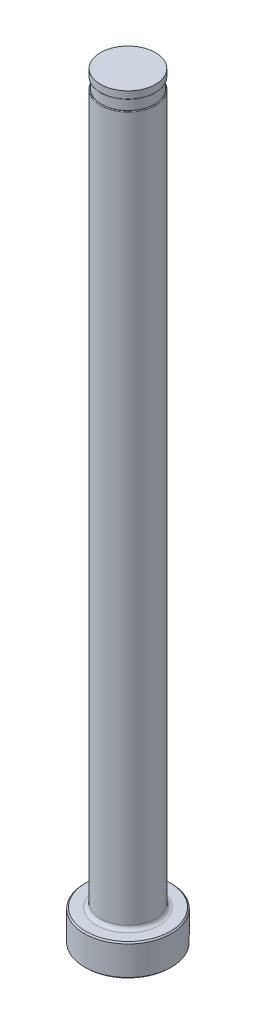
ISO-10303-21;
HEADER;
FILE_DESCRIPTION(('STEP AP214'),'2;1');
FILE_NAME('part.step','',(''),(''),'','','');
FILE_SCHEMA(('AUTOMOTIVE_DESIGN { 1 0 10303 214 1 1 1 1 }'));
ENDSEC;
DATA;
#1=APPLICATION_CONTEXT('core data for automotive mechanical design processes');
#2=APPLICATION_PROTOCOL_DEFINITION('international standard','automotive_design',2000,#1);
#3=PRODUCT_CONTEXT('',#1,'mechanical');
#4=PRODUCT('Part','Part','',(#3));
#5=PRODUCT_RELATED_PRODUCT_CATEGORY('part','',(#4));
#6=PRODUCT_DEFINITION_FORMATION('','',#4);
#7=PRODUCT_DEFINITION_CONTEXT('part definition',#1,'design');
#8=PRODUCT_DEFINITION('design','',#6,#7);
#9=PRODUCT_DEFINITION_SHAPE('','',#8);
#10=(LENGTH_UNIT() NAMED_UNIT(*) SI_UNIT(.MILLI.,.METRE.));
#11=(NAMED_UNIT(*) PLANE_ANGLE_UNIT() SI_UNIT($,.RADIAN.));
#12=(NAMED_UNIT(*) SI_UNIT($,.STERADIAN.) SOLID_ANGLE_UNIT());
#13=UNCERTAINTY_MEASURE_WITH_UNIT(LENGTH_MEASURE(1.E-05),#10,'distance_accuracy_value','');
#14=(GEOMETRIC_REPRESENTATION_CONTEXT(3) GLOBAL_UNCERTAINTY_ASSIGNED_CONTEXT((#13)) GLOBAL_UNIT_ASSIGNED_CONTEXT((#10,
#11,#12)) REPRESENTATION_CONTEXT('',''));
#15=CARTESIAN_POINT('',(0.,0.,0.));
#16=DIRECTION('',(0.,0.,1.));
#17=DIRECTION('',(1.,0.,0.));
#18=AXIS2_PLACEMENT_3D('',#15,#16,#17);
#19=CARTESIAN_POINT('',(-5.55624999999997,150.876,0.));
#20=DIRECTION('',(0.,1.,0.));
#21=DIRECTION('',(0.,0.,1.));
#22=AXIS2_PLACEMENT_3D('',#19,#20,#21);
#23=PLANE('',#22);
#24=CARTESIAN_POINT('',(0.,150.876,0.));
#25=DIRECTION('',(0.,1.,0.));
#26=DIRECTION('',(0.,0.,1.));
#27=AXIS2_PLACEMENT_3D('',#24,#25,#26);
#28=CIRCLE('',#27,5.40384999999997);
#29=CARTESIAN_POINT('',(0.,150.876,5.40384999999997));
#30=VERTEX_POINT('',#29);
#31=EDGE_CURVE('E11',#30,#30,#28,.F.);
#32=ORIENTED_EDGE('',*,*,#31,.T.);
#33=EDGE_LOOP('',(#32));
#34=FACE_BOUND('',#33,.T.);
#35=CARTESIAN_POINT('',(0.,150.876,0.));
#36=DIRECTION('',(0.,1.,0.));
#37=DIRECTION('',(0.,0.,1.));
#38=AXIS2_PLACEMENT_3D('',#35,#36,#37);
#39=CIRCLE('',#38,5.35304999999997);
#40=CARTESIAN_POINT('',(0.,150.876,5.35304999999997));
#41=VERTEX_POINT('',#40);
#42=EDGE_CURVE('E78',#41,#41,#39,.T.);
#43=ORIENTED_EDGE('',*,*,#42,.T.);
#44=EDGE_LOOP('',(#43));
#45=FACE_BOUND('',#44,.T.);
#46=ADVANCED_FACE('F36',(#34,#45),#23,.F.);
#47=CARTESIAN_POINT('',(0.,259.958771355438,0.));
#48=DIRECTION('',(0.,1.,0.));
#49=DIRECTION('',(0.,0.,1.));
#50=AXIS2_PLACEMENT_3D('',#47,#48,#49);
#51=CYLINDRICAL_SURFACE('',#50,5.55624999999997);
#52=DIRECTION('',(0.,1.,0.));
#53=VECTOR('',#52,1.);
#54=CARTESIAN_POINT('',(-5.35304999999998,259.958771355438,-1.48888205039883));
#55=LINE('',#54,#53);
#56=CARTESIAN_POINT('',(-5.35304999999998,148.717,-1.48888205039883));
#57=VERTEX_POINT('',#56);
#58=CARTESIAN_POINT('',(-5.35304999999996,86.36,-1.48888205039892));
#59=VERTEX_POINT('',#58);
#60=EDGE_CURVE('E73',#57,#59,#55,.F.);
#61=ORIENTED_EDGE('',*,*,#60,.F.);
#62=CARTESIAN_POINT('',(0.,148.717,0.));
#63=DIRECTION('',(0.,-1.,0.));
#64=DIRECTION('',(0.,0.,-1.));
#65=AXIS2_PLACEMENT_3D('',#62,#63,#64);
#66=CIRCLE('',#65,5.55624999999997);
#67=CARTESIAN_POINT('',(-5.35304999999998,148.717,1.48888205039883));
#68=VERTEX_POINT('',#67);
#69=EDGE_CURVE('E51',#57,#68,#66,.T.);
#70=ORIENTED_EDGE('',*,*,#69,.T.);
#71=DIRECTION('',(0.,1.,0.));
#72=VECTOR('',#71,1.);
#73=CARTESIAN_POINT('',(-5.35304999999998,259.958771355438,1.48888205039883));
#74=LINE('',#73,#72);
#75=CARTESIAN_POINT('',(-5.35304999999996,86.36,1.48888205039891));
#76=VERTEX_POINT('',#75);
#77=EDGE_CURVE('E84',#76,#68,#74,.T.);
#78=ORIENTED_EDGE('',*,*,#77,.F.);
#79=CARTESIAN_POINT('',(-5.35304999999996,86.36,-1.48888205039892));
#80=CARTESIAN_POINT('',(-5.35304712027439,86.3319400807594,-1.48888592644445));
#81=CARTESIAN_POINT('',(-5.35342246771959,86.303898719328,-1.48754344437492));
#82=CARTESIAN_POINT('',(-5.35490012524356,86.2481072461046,-1.48221807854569));
#83=CARTESIAN_POINT('',(-5.3560019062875,86.2203569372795,-1.47823711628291));
#84=CARTESIAN_POINT('',(-5.36032637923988,86.1383774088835,-1.46251079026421));
#85=CARTESIAN_POINT('',(-5.36456936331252,86.0848852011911,-1.44697968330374));
#86=CARTESIAN_POINT('',(-5.37522073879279,85.9818696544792,-1.40688871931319));
#87=CARTESIAN_POINT('',(-5.38162399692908,85.9323372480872,-1.38235025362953));
#88=CARTESIAN_POINT('',(-5.39588416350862,85.8380393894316,-1.3255962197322));
#89=CARTESIAN_POINT('',(-5.40374399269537,85.7932838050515,-1.29336518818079));
#90=CARTESIAN_POINT('',(-5.42234104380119,85.6980810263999,-1.21335067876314));
#91=CARTESIAN_POINT('',(-5.43329059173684,85.6492435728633,-1.16370716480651));
#92=CARTESIAN_POINT('',(-5.45504519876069,85.5603973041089,-1.05705847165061));
#93=CARTESIAN_POINT('',(-5.46585002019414,85.5204016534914,-1.0000425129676));
#94=CARTESIAN_POINT('',(-5.48941062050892,85.4382379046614,-0.862814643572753));
#95=CARTESIAN_POINT('',(-5.50177933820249,85.3990172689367,-0.780775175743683));
#96=CARTESIAN_POINT('',(-5.52319531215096,85.3340184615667,-0.61119833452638));
#97=CARTESIAN_POINT('',(-5.53224012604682,85.3082501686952,-0.523656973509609));
#98=CARTESIAN_POINT('',(-5.54633656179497,85.2689210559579,-0.343981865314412));
#99=CARTESIAN_POINT('',(-5.551315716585,85.2555811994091,-0.251794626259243));
#100=CARTESIAN_POINT('',(-5.55663041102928,85.2413656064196,-0.0663077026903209));
#101=CARTESIAN_POINT('',(-5.5569631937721,85.2404972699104,0.0269926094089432));
#102=CARTESIAN_POINT('',(-5.55261816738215,85.2520778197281,0.228128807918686));
#103=CARTESIAN_POINT('',(-5.5471061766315,85.2667433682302,0.335828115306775));
#104=CARTESIAN_POINT('',(-5.53028051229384,85.3137503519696,0.546872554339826));
#105=CARTESIAN_POINT('',(-5.51897217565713,85.34607552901,0.650221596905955));
#106=CARTESIAN_POINT('',(-5.49592210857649,85.4177771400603,0.81966257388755));
#107=CARTESIAN_POINT('',(-5.48524552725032,85.452432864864,0.88790475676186));
#108=CARTESIAN_POINT('',(-5.46261932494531,85.5320662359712,1.01785270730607));
#109=CARTESIAN_POINT('',(-5.45067176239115,85.5770273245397,1.07956873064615));
#110=CARTESIAN_POINT('',(-5.42934912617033,85.6669408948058,1.18161350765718));
#111=CARTESIAN_POINT('',(-5.41996423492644,85.7098853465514,1.22370530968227));
#112=CARTESIAN_POINT('',(-5.40207756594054,85.8022163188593,1.30039205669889));
#113=CARTESIAN_POINT('',(-5.3935749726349,85.8515967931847,1.33499395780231));
#114=CARTESIAN_POINT('',(-5.37957377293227,85.9480291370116,1.39024779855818));
#115=CARTESIAN_POINT('',(-5.37381465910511,85.9942834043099,1.4122235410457));
#116=CARTESIAN_POINT('',(-5.36419527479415,86.0899194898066,1.44833565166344));
#117=CARTESIAN_POINT('',(-5.36033174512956,86.1392957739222,1.46248548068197));
#118=CARTESIAN_POINT('',(-5.3561211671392,86.217574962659,1.47780624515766));
#119=CARTESIAN_POINT('',(-5.35497463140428,86.24588137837,1.48194947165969));
#120=CARTESIAN_POINT('',(-5.35343719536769,86.3027860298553,1.48749027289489));
#121=CARTESIAN_POINT('',(-5.35304641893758,86.3313843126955,1.4888873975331));
#122=CARTESIAN_POINT('',(-5.35304999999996,86.36,1.48888205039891));
#123=B_SPLINE_CURVE_WITH_KNOTS('',3,(#79,#80,#81,#82,#83,#84,#85,#86,#87,#88,#89,#90,#91,#92,
#93,#94,#95,#96,#97,#98,#99,#100,#101,#102,#103,#104,#105,#106,#107,#108,#109,#110,#111,#112,
#113,#114,#115,#116,#117,#118,#119,#120,#121,#122),.UNSPECIFIED.,.F.,.F.,(4,2,2,2,2,2,2,2,2,2,2,
2,2,2,2,2,2,2,2,2,2,4),(0.,0.0841097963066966,0.168158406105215,0.334679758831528,
0.50080817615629,0.667273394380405,0.87762078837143,1.0882792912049,1.36213137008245,
1.63618427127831,1.91502141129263,2.19402399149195,2.51897339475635,2.84362413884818,
3.07466463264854,3.30533648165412,3.48723774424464,3.66896933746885,3.82292542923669,
3.97661588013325,4.06237930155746,4.14815677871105),.UNSPECIFIED.);
#124=EDGE_CURVE('E81',#59,#76,#123,.T.);
#125=ORIENTED_EDGE('',*,*,#124,.F.);
#126=EDGE_LOOP('',(#61,#70,#78,#125));
#127=FACE_BOUND('',#126,.T.);
#128=CARTESIAN_POINT('',(0.,7.11200000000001,0.));
#129=DIRECTION('',(0.,1.,0.));
#130=DIRECTION('',(0.,0.,1.));
#131=AXIS2_PLACEMENT_3D('',#128,#129,#130);
#132=CIRCLE('',#131,5.55624999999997);
#133=CARTESIAN_POINT('',(0.,7.11200000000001,5.55624999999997));
#134=VERTEX_POINT('',#133);
#135=EDGE_CURVE('E116',#134,#134,#132,.T.);
#136=ORIENTED_EDGE('',*,*,#135,.T.);
#137=EDGE_LOOP('',(#136));
#138=FACE_BOUND('',#137,.T.);
#139=ADVANCED_FACE('F82',(#127,#138),#51,.T.);
#140=CARTESIAN_POINT('',(0.,0.,0.));
#141=DIRECTION('',(0.,-1.,0.));
#142=DIRECTION('',(0.,0.,-1.));
#143=AXIS2_PLACEMENT_3D('',#140,#141,#142);
#144=PLANE('',#143);
#145=CARTESIAN_POINT('',(0.,0.,0.));
#146=DIRECTION('',(0.,-1.,0.));
#147=DIRECTION('',(0.,0.,-1.));
#148=AXIS2_PLACEMENT_3D('',#145,#146,#147);
#149=CIRCLE('',#148,8.47089999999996);
#150=CARTESIAN_POINT('',(0.,0.,-8.47089999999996));
#151=VERTEX_POINT('',#150);
#152=EDGE_CURVE('E113',#151,#151,#149,.T.);
#153=ORIENTED_EDGE('',*,*,#152,.T.);
#154=EDGE_LOOP('',(#153));
#155=FACE_BOUND('',#154,.T.);
#156=ADVANCED_FACE('F192',(#155),#144,.T.);
#157=CARTESIAN_POINT('',(0.,259.958771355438,0.));
#158=DIRECTION('',(0.,1.,0.));
#159=DIRECTION('',(0.,0.,1.));
#160=AXIS2_PLACEMENT_3D('',#157,#158,#159);
#161=CYLINDRICAL_SURFACE('',#160,8.72489999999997);
#162=CARTESIAN_POINT('',(0.,6.09600000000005,0.));
#163=DIRECTION('',(0.,1.,0.));
#164=DIRECTION('',(0.,0.,1.));
#165=AXIS2_PLACEMENT_3D('',#162,#163,#164);
#166=CIRCLE('',#165,8.72489999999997);
#167=CARTESIAN_POINT('',(0.,6.09600000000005,8.72489999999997));
#168=VERTEX_POINT('',#167);
#169=EDGE_CURVE('E110',#168,#168,#166,.F.);
#170=ORIENTED_EDGE('',*,*,#169,.T.);
#171=EDGE_LOOP('',(#170));
#172=FACE_BOUND('',#171,.T.);
#173=CARTESIAN_POINT('',(0.,0.254000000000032,0.));
#174=DIRECTION('',(0.,-1.,0.));
#175=DIRECTION('',(0.,0.,-1.));
#176=AXIS2_PLACEMENT_3D('',#173,#174,#175);
#177=CIRCLE('',#176,8.72489999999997);
#178=CARTESIAN_POINT('',(0.,0.254000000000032,-8.72489999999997));
#179=VERTEX_POINT('',#178);
#180=EDGE_CURVE('E107',#179,#179,#177,.F.);
#181=ORIENTED_EDGE('',*,*,#180,.T.);
#182=EDGE_LOOP('',(#181));
#183=FACE_BOUND('',#182,.T.);
#184=ADVANCED_FACE('F195',(#172,#183),#161,.T.);
#185=CARTESIAN_POINT('',(-8.72489999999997,6.35,0.));
#186=DIRECTION('',(0.,1.,0.));
#187=DIRECTION('',(0.,0.,1.));
#188=AXIS2_PLACEMENT_3D('',#185,#186,#187);
#189=PLANE('',#188);
#190=CARTESIAN_POINT('',(0.,6.35,0.));
#191=DIRECTION('',(0.,1.,0.));
#192=DIRECTION('',(0.,0.,1.));
#193=AXIS2_PLACEMENT_3D('',#190,#191,#192);
#194=CIRCLE('',#193,6.31824999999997);
#195=CARTESIAN_POINT('',(0.,6.35,6.31824999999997));
#196=VERTEX_POINT('',#195);
#197=EDGE_CURVE('E87',#196,#196,#194,.F.);
#198=ORIENTED_EDGE('',*,*,#197,.T.);
#199=EDGE_LOOP('',(#198));
#200=FACE_BOUND('',#199,.T.);
#201=CARTESIAN_POINT('',(0.,6.35,0.));
#202=DIRECTION('',(0.,1.,0.));
#203=DIRECTION('',(0.,0.,1.));
#204=AXIS2_PLACEMENT_3D('',#201,#202,#203);
#205=CIRCLE('',#204,8.47090000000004);
#206=CARTESIAN_POINT('',(0.,6.35,8.47090000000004));
#207=VERTEX_POINT('',#206);
#208=EDGE_CURVE('E104',#207,#207,#205,.T.);
#209=ORIENTED_EDGE('',*,*,#208,.T.);
#210=EDGE_LOOP('',(#209));
#211=FACE_BOUND('',#210,.T.);
#212=ADVANCED_FACE('F190',(#200,#211),#189,.T.);
#213=CARTESIAN_POINT('',(0.,6.35000000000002,0.));
#214=DIRECTION('',(0.,-1.,0.));
#215=DIRECTION('',(0.,0.,-1.));
#216=AXIS2_PLACEMENT_3D('',#213,#214,#215);
#217=CONICAL_SURFACE('',#216,8.47090000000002,0.785398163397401);
#218=ORIENTED_EDGE('',*,*,#169,.F.);
#219=EDGE_LOOP('',(#218));
#220=FACE_BOUND('',#219,.T.);
#221=ORIENTED_EDGE('',*,*,#208,.F.);
#222=EDGE_LOOP('',(#221));
#223=FACE_BOUND('',#222,.T.);
#224=ADVANCED_FACE('F186',(#220,#223),#217,.T.);
#225=CARTESIAN_POINT('',(0.,0.254000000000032,0.));
#226=DIRECTION('',(0.,1.,0.));
#227=DIRECTION('',(0.,0.,1.));
#228=AXIS2_PLACEMENT_3D('',#225,#226,#227);
#229=CONICAL_SURFACE('',#228,8.72489999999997,0.785398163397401);
#230=ORIENTED_EDGE('',*,*,#152,.F.);
#231=EDGE_LOOP('',(#230));
#232=FACE_BOUND('',#231,.T.);
#233=ORIENTED_EDGE('',*,*,#180,.F.);
#234=EDGE_LOOP('',(#233));
#235=FACE_BOUND('',#234,.T.);
#236=ADVANCED_FACE('F182',(#232,#235),#229,.T.);
#237=CARTESIAN_POINT('',(0.,7.11200000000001,0.));
#238=DIRECTION('',(0.,1.,0.));
#239=DIRECTION('',(0.,0.,1.));
#240=AXIS2_PLACEMENT_3D('',#237,#238,#239);
#241=TOROIDAL_SURFACE('',#240,6.31824999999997,0.762);
#242=ORIENTED_EDGE('',*,*,#197,.F.);
#243=EDGE_LOOP('',(#242));
#244=FACE_BOUND('',#243,.T.);
#245=ORIENTED_EDGE('',*,*,#135,.F.);
#246=EDGE_LOOP('',(#245));
#247=FACE_BOUND('',#246,.T.);
#248=ADVANCED_FACE('F147',(#244,#247),#241,.F.);
#249=CARTESIAN_POINT('',(-5.55624999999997,148.844,0.));
#250=DIRECTION('',(0.,-1.,0.));
#251=DIRECTION('',(0.,0.,-1.));
#252=AXIS2_PLACEMENT_3D('',#249,#250,#251);
#253=PLANE('',#252);
#254=DIRECTION('',(0.,0.,1.));
#255=VECTOR('',#254,1.);
#256=CARTESIAN_POINT('',(-5.35304999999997,148.844,0.));
#257=LINE('',#256,#255);
#258=CARTESIAN_POINT('',(-5.35304999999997,148.844,0.));
#259=VERTEX_POINT('',#258);
#260=CARTESIAN_POINT('',(-5.35304999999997,148.844,0.906427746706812));
#261=VERTEX_POINT('',#260);
#262=EDGE_CURVE('E90',#259,#261,#257,.T.);
#263=ORIENTED_EDGE('',*,*,#262,.T.);
#264=CARTESIAN_POINT('',(0.,148.844,0.));
#265=DIRECTION('',(0.,-1.,0.));
#266=DIRECTION('',(0.,0.,-1.));
#267=AXIS2_PLACEMENT_3D('',#264,#265,#266);
#268=CIRCLE('',#267,5.42924999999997);
#269=CARTESIAN_POINT('',(-5.35304999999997,148.844,-0.906427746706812));
#270=VERTEX_POINT('',#269);
#271=EDGE_CURVE('E86',#261,#270,#268,.F.);
#272=ORIENTED_EDGE('',*,*,#271,.T.);
#273=EDGE_CURVE('E79',#270,#259,#257,.T.);
#274=ORIENTED_EDGE('',*,*,#273,.T.);
#275=CARTESIAN_POINT('',(0.,148.844,0.));
#276=DIRECTION('',(0.,1.,0.));
#277=DIRECTION('',(0.,0.,1.));
#278=AXIS2_PLACEMENT_3D('',#275,#276,#277);
#279=CIRCLE('',#278,5.35304999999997);
#280=EDGE_CURVE('E101',#259,#259,#279,.T.);
#281=ORIENTED_EDGE('',*,*,#280,.F.);
#282=EDGE_LOOP('',(#263,#272,#274,#281));
#283=FACE_BOUND('',#282,.T.);
#284=ADVANCED_FACE('F144',(#283),#253,.F.);
#285=CARTESIAN_POINT('',(0.,153.448281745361,0.));
#286=DIRECTION('',(0.,1.,0.));
#287=DIRECTION('',(0.,0.,1.));
#288=AXIS2_PLACEMENT_3D('',#285,#286,#287);
#289=CYLINDRICAL_SURFACE('',#288,5.35304999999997);
#290=ORIENTED_EDGE('',*,*,#42,.F.);
#291=EDGE_LOOP('',(#290));
#292=FACE_BOUND('',#291,.T.);
#293=ORIENTED_EDGE('',*,*,#280,.T.);
#294=EDGE_LOOP('',(#293));
#295=FACE_BOUND('',#294,.T.);
#296=ADVANCED_FACE('F141',(#292,#295),#289,.T.);
#297=CARTESIAN_POINT('',(-5.35304999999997,149.86,-8.72489999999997));
#298=DIRECTION('',(1.,0.,0.));
#299=DIRECTION('',(0.,1.,0.));
#300=AXIS2_PLACEMENT_3D('',#297,#298,#299);
#301=PLANE('',#300);
#302=ORIENTED_EDGE('',*,*,#273,.F.);
#303=CARTESIAN_POINT('',(-5.35304999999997,148.844,-0.906427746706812));
#304=CARTESIAN_POINT('',(-5.35304999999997,148.843997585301,-0.927323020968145));
#305=CARTESIAN_POINT('',(-5.35304999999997,148.843856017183,-0.948219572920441));
#306=CARTESIAN_POINT('',(-5.35304999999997,148.843220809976,-0.990022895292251));
#307=CARTESIAN_POINT('',(-5.35304999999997,148.84272690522,-1.01092966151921));
#308=CARTESIAN_POINT('',(-5.35304999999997,148.841293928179,-1.05329459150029));
#309=CARTESIAN_POINT('',(-5.35304999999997,148.840343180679,-1.07475238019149));
#310=CARTESIAN_POINT('',(-5.35304999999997,148.837886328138,-1.11762595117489));
#311=CARTESIAN_POINT('',(-5.35304999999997,148.836380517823,-1.13904174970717));
#312=CARTESIAN_POINT('',(-5.35304999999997,148.832668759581,-1.18182014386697));
#313=CARTESIAN_POINT('',(-5.35304999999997,148.830462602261,-1.20318272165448));
#314=CARTESIAN_POINT('',(-5.35304999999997,148.825137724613,-1.24583267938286));
#315=CARTESIAN_POINT('',(-5.35304999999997,148.822017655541,-1.26711990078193));
#316=CARTESIAN_POINT('',(-5.35304999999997,148.814562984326,-1.30920547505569));
#317=CARTESIAN_POINT('',(-5.35304999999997,148.810244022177,-1.33000661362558));
#318=CARTESIAN_POINT('',(-5.35304999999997,148.799803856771,-1.37114198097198));
#319=CARTESIAN_POINT('',(-5.35304999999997,148.793688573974,-1.39147751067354));
#320=CARTESIAN_POINT('',(-5.35304999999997,148.783778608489,-1.41655009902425));
#321=CARTESIAN_POINT('',(-5.35304999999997,148.781524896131,-1.4218879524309));
#322=CARTESIAN_POINT('',(-5.35304999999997,148.776682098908,-1.43243190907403));
#323=CARTESIAN_POINT('',(-5.35304999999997,148.774092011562,-1.43763756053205));
#324=CARTESIAN_POINT('',(-5.35304999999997,148.768182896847,-1.44837668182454));
#325=CARTESIAN_POINT('',(-5.35304999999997,148.764815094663,-1.45388357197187));
#326=CARTESIAN_POINT('',(-5.35304999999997,148.757355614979,-1.4643862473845));
#327=CARTESIAN_POINT('',(-5.35304999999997,148.753267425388,-1.4693843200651));
#328=CARTESIAN_POINT('',(-5.35304999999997,148.746750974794,-1.47569818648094));
#329=CARTESIAN_POINT('',(-5.35304999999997,148.744754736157,-1.4774548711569));
#330=CARTESIAN_POINT('',(-5.35304999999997,148.740555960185,-1.48070710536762));
#331=CARTESIAN_POINT('',(-5.35304999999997,148.738353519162,-1.48220277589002));
#332=CARTESIAN_POINT('',(-5.35304999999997,148.734086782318,-1.48462572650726));
#333=CARTESIAN_POINT('',(-5.35304999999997,148.732052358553,-1.48560484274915));
#334=CARTESIAN_POINT('',(-5.35304999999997,148.727851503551,-1.48721324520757));
#335=CARTESIAN_POINT('',(-5.35304999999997,148.725685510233,-1.48784362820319));
#336=CARTESIAN_POINT('',(-5.35304999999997,148.722414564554,-1.48846795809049));
#337=CARTESIAN_POINT('',(-5.35304999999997,148.721338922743,-1.48862246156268));
#338=CARTESIAN_POINT('',(-5.35304999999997,148.719175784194,-1.48882979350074));
#339=CARTESIAN_POINT('',(-5.35304999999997,148.718088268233,-1.48888242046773));
#340=CARTESIAN_POINT('',(-5.35304999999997,148.717,-1.48888205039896));
#341=B_SPLINE_CURVE_WITH_KNOTS('',3,(#303,#304,#305,#306,#307,#308,#309,#310,#311,#312,#313,
#314,#315,#316,#317,#318,#319,#320,#321,#322,#323,#324,#325,#326,#327,#328,#329,#330,#331,#332,
#333,#334,#335,#336,#337,#338,#339,#340),.UNSPECIFIED.,.F.,.F.,(4,2,2,2,2,2,2,2,2,2,2,2,2,2,2,2,
2,2,4),(0.,0.0626873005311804,0.125421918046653,0.189852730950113,0.254249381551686,
0.318665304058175,0.383176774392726,0.446883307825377,0.510382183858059,0.527756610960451,
0.54518406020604,0.564521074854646,0.583766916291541,0.591729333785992,0.599688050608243,
0.606437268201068,0.613165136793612,0.616420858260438,0.619683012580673),.UNSPECIFIED.);
#342=EDGE_CURVE('E59',#270,#57,#341,.T.);
#343=ORIENTED_EDGE('',*,*,#342,.T.);
#344=ORIENTED_EDGE('',*,*,#60,.T.);
#345=DIRECTION('',(0.,0.,1.));
#346=VECTOR('',#345,1.);
#347=CARTESIAN_POINT('',(-5.35304999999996,86.36,-8.72489999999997));
#348=LINE('',#347,#346);
#349=EDGE_CURVE('E77',#59,#76,#348,.T.);
#350=ORIENTED_EDGE('',*,*,#349,.T.);
#351=ORIENTED_EDGE('',*,*,#77,.T.);
#352=CARTESIAN_POINT('',(-5.35304999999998,148.717,1.48888205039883));
#353=CARTESIAN_POINT('',(-5.35304999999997,148.719315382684,1.48889020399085));
#354=CARTESIAN_POINT('',(-5.35304999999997,148.721618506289,1.48864616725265));
#355=CARTESIAN_POINT('',(-5.35304999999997,148.726103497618,1.48773344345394));
#356=CARTESIAN_POINT('',(-5.35304999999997,148.728286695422,1.48707143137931));
#357=CARTESIAN_POINT('',(-5.35304999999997,148.733009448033,1.48520073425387));
#358=CARTESIAN_POINT('',(-5.35304999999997,148.735511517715,1.4838999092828));
#359=CARTESIAN_POINT('',(-5.35304999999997,148.74028827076,1.48091465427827));
#360=CARTESIAN_POINT('',(-5.35304999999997,148.742561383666,1.47922780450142));
#361=CARTESIAN_POINT('',(-5.35304999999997,148.748524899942,1.47421628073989));
#362=CARTESIAN_POINT('',(-5.35304999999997,148.751983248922,1.47061948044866));
#363=CARTESIAN_POINT('',(-5.35304999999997,148.758372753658,1.4629969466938));
#364=CARTESIAN_POINT('',(-5.35304999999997,148.761302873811,1.45897039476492));
#365=CARTESIAN_POINT('',(-5.35304999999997,148.76818028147,1.44851786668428));
#366=CARTESIAN_POINT('',(-5.35304999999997,148.77187230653,1.44192584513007));
#367=CARTESIAN_POINT('',(-5.35304999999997,148.778640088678,1.42842790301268));
#368=CARTESIAN_POINT('',(-5.35304999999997,148.781714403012,1.42152129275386));
#369=CARTESIAN_POINT('',(-5.35304999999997,148.790282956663,1.40046246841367));
#370=CARTESIAN_POINT('',(-5.35304999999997,148.795087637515,1.38603333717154));
#371=CARTESIAN_POINT('',(-5.35304999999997,148.807626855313,1.34303383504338));
#372=CARTESIAN_POINT('',(-5.35304999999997,148.813813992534,1.31403988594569));
#373=CARTESIAN_POINT('',(-5.35304999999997,148.823934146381,1.25562656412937));
#374=CARTESIAN_POINT('',(-5.35304999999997,148.82786080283,1.22620622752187));
#375=CARTESIAN_POINT('',(-5.35304999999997,148.834178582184,1.16719231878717));
#376=CARTESIAN_POINT('',(-5.35304999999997,148.836569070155,1.13759868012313));
#377=CARTESIAN_POINT('',(-5.35304999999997,148.840250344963,1.07838180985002));
#378=CARTESIAN_POINT('',(-5.35304999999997,148.841542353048,1.04875864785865));
#379=CARTESIAN_POINT('',(-5.35304999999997,148.842983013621,1.00031217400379));
#380=CARTESIAN_POINT('',(-5.35304999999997,148.84337689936,0.98149542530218));
#381=CARTESIAN_POINT('',(-5.35304999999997,148.843884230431,0.943928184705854));
#382=CARTESIAN_POINT('',(-5.35304999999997,148.843998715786,0.925177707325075));
#383=CARTESIAN_POINT('',(-5.35304999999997,148.844,0.906427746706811));
#384=B_SPLINE_CURVE_WITH_KNOTS('',3,(#352,#353,#354,#355,#356,#357,#358,#359,#360,#361,#362,
#363,#364,#365,#366,#367,#368,#369,#370,#371,#372,#373,#374,#375,#376,#377,#378,#379,#380,#381,
#382,#383),.UNSPECIFIED.,.F.,.F.,(4,2,2,2,2,2,2,2,2,2,2,2,2,2,2,4),(0.,0.00691371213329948,
0.0137197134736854,0.0221318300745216,0.0305981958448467,0.0454833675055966,0.0603974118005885,
0.0830067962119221,0.105668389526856,0.151203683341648,0.23995736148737,0.328959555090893,
0.41799851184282,0.506938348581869,0.563399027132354,0.619649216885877),.UNSPECIFIED.);
#385=EDGE_CURVE('E172',#68,#261,#384,.T.);
#386=ORIENTED_EDGE('',*,*,#385,.T.);
#387=ORIENTED_EDGE('',*,*,#262,.F.);
#388=EDGE_LOOP('',(#302,#343,#344,#350,#351,#386,#387));
#389=FACE_BOUND('',#388,.T.);
#390=ADVANCED_FACE('F75',(#389),#301,.F.);
#391=CARTESIAN_POINT('',(-8.52804999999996,86.36,-8.72489999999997));
#392=DIRECTION('',(0.,0.,1.));
#393=DIRECTION('',(1.,0.,0.));
#394=AXIS2_PLACEMENT_3D('',#391,#392,#393);
#395=CYLINDRICAL_SURFACE('',#394,3.175);
#396=ORIENTED_EDGE('',*,*,#349,.F.);
#397=ORIENTED_EDGE('',*,*,#124,.T.);
#398=EDGE_LOOP('',(#396,#397));
#399=FACE_BOUND('',#398,.T.);
#400=ADVANCED_FACE('F89',(#399),#395,.F.);
#401=CARTESIAN_POINT('',(0.,152.687735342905,0.));
#402=DIRECTION('',(0.,1.,0.));
#403=DIRECTION('',(0.,0.,1.));
#404=AXIS2_PLACEMENT_3D('',#401,#402,#403);
#405=CYLINDRICAL_SURFACE('',#404,5.53084999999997);
#406=CARTESIAN_POINT('',(0.,151.003,0.));
#407=DIRECTION('',(0.,1.,0.));
#408=DIRECTION('',(0.,0.,1.));
#409=AXIS2_PLACEMENT_3D('',#406,#407,#408);
#410=CIRCLE('',#409,5.53084999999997);
#411=CARTESIAN_POINT('',(0.,151.003,5.53084999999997));
#412=VERTEX_POINT('',#411);
#413=EDGE_CURVE('E44',#412,#412,#410,.T.);
#414=ORIENTED_EDGE('',*,*,#413,.T.);
#415=EDGE_LOOP('',(#414));
#416=FACE_BOUND('',#415,.T.);
#417=CARTESIAN_POINT('',(0.,152.4,0.));
#418=DIRECTION('',(0.,1.,0.));
#419=DIRECTION('',(0.,0.,1.));
#420=AXIS2_PLACEMENT_3D('',#417,#418,#419);
#421=CIRCLE('',#420,5.53084999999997);
#422=CARTESIAN_POINT('',(0.,152.4,5.53084999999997));
#423=VERTEX_POINT('',#422);
#424=EDGE_CURVE('E91',#423,#423,#421,.T.);
#425=ORIENTED_EDGE('',*,*,#424,.F.);
#426=EDGE_LOOP('',(#425));
#427=FACE_BOUND('',#426,.T.);
#428=ADVANCED_FACE('F135',(#416,#427),#405,.T.);
#429=CARTESIAN_POINT('',(-5.55624999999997,152.4,0.));
#430=DIRECTION('',(0.,1.,0.));
#431=DIRECTION('',(0.,0.,1.));
#432=AXIS2_PLACEMENT_3D('',#429,#430,#431);
#433=PLANE('',#432);
#434=ORIENTED_EDGE('',*,*,#424,.T.);
#435=EDGE_LOOP('',(#434));
#436=FACE_BOUND('',#435,.T.);
#437=ADVANCED_FACE('F149',(#436),#433,.T.);
#438=CARTESIAN_POINT('',(0.,148.717,0.));
#439=DIRECTION('',(0.,-1.,0.));
#440=DIRECTION('',(0.,0.,-1.));
#441=AXIS2_PLACEMENT_3D('',#438,#439,#440);
#442=TOROIDAL_SURFACE('',#441,5.42924999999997,0.127);
#443=ORIENTED_EDGE('',*,*,#385,.F.);
#444=ORIENTED_EDGE('',*,*,#69,.F.);
#445=ORIENTED_EDGE('',*,*,#342,.F.);
#446=ORIENTED_EDGE('',*,*,#271,.F.);
#447=EDGE_LOOP('',(#443,#444,#445,#446));
#448=FACE_BOUND('',#447,.T.);
#449=ADVANCED_FACE('F151',(#448),#442,.T.);
#450=CARTESIAN_POINT('',(0.,151.003,0.));
#451=DIRECTION('',(0.,1.,0.));
#452=DIRECTION('',(0.,0.,1.));
#453=AXIS2_PLACEMENT_3D('',#450,#451,#452);
#454=TOROIDAL_SURFACE('',#453,5.40384999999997,0.127);
#455=ORIENTED_EDGE('',*,*,#31,.F.);
#456=EDGE_LOOP('',(#455));
#457=FACE_BOUND('',#456,.T.);
#458=ORIENTED_EDGE('',*,*,#413,.F.);
#459=EDGE_LOOP('',(#458));
#460=FACE_BOUND('',#459,.T.);
#461=ADVANCED_FACE('F38',(#457,#460),#454,.T.);
#462=CLOSED_SHELL('',(#46,#139,#156,#184,#212,#224,#236,#248,#284,#296,#390,#400,#428,#437,#449,#461));
#463=MANIFOLD_SOLID_BREP('B2',#462);
#464=ADVANCED_BREP_SHAPE_REPRESENTATION('',(#18,#463),#14);
#465=SHAPE_DEFINITION_REPRESENTATION(#9,#464);
ENDSEC;
END-ISO-10303-21;
